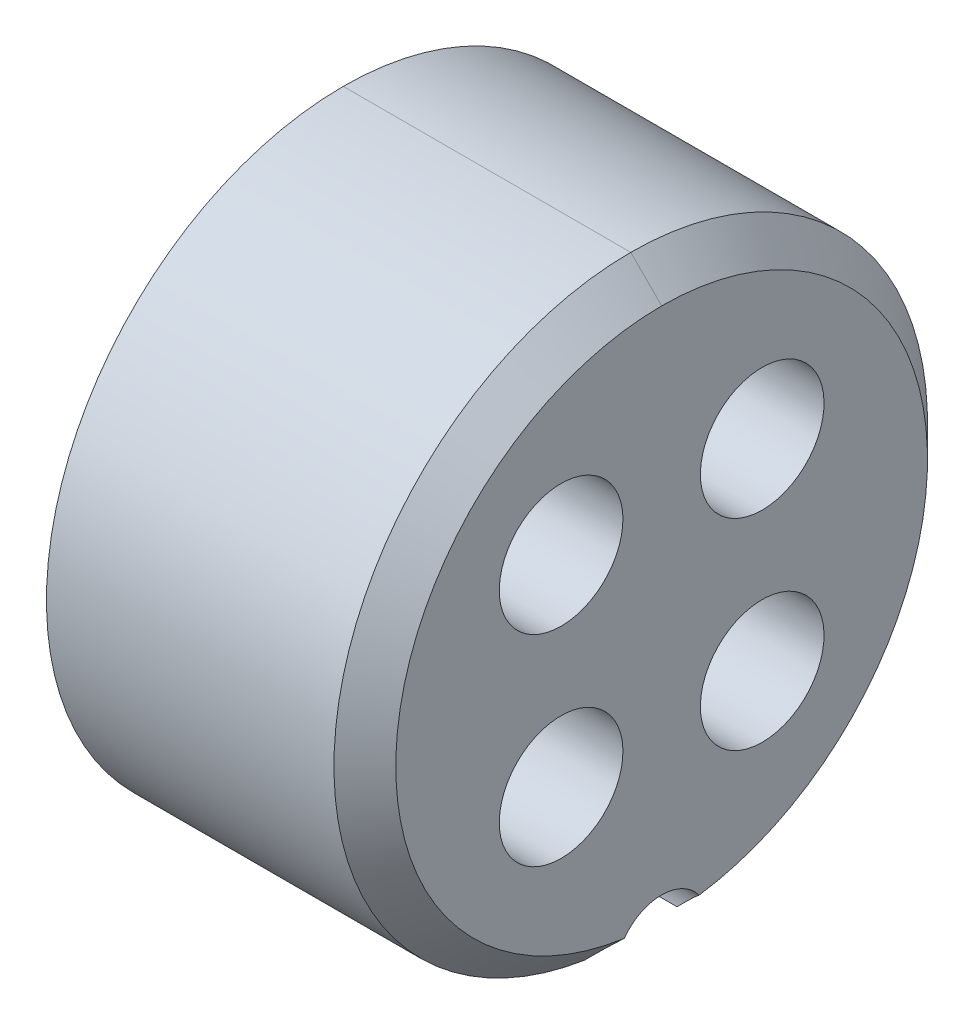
ISO-10303-21;
HEADER;
FILE_DESCRIPTION(('STEP AP214'),'2;1');
FILE_NAME('part.step','',(''),(''),'','','');
FILE_SCHEMA(('AUTOMOTIVE_DESIGN { 1 0 10303 214 1 1 1 1 }'));
ENDSEC;
DATA;
#1=APPLICATION_CONTEXT('core data for automotive mechanical design processes');
#2=APPLICATION_PROTOCOL_DEFINITION('international standard','automotive_design',2000,#1);
#3=PRODUCT_CONTEXT('',#1,'mechanical');
#4=PRODUCT('Part','Part','',(#3));
#5=PRODUCT_RELATED_PRODUCT_CATEGORY('part','',(#4));
#6=PRODUCT_DEFINITION_FORMATION('','',#4);
#7=PRODUCT_DEFINITION_CONTEXT('part definition',#1,'design');
#8=PRODUCT_DEFINITION('design','',#6,#7);
#9=PRODUCT_DEFINITION_SHAPE('','',#8);
#10=(LENGTH_UNIT() NAMED_UNIT(*) SI_UNIT(.MILLI.,.METRE.));
#11=(NAMED_UNIT(*) PLANE_ANGLE_UNIT() SI_UNIT($,.RADIAN.));
#12=(NAMED_UNIT(*) SI_UNIT($,.STERADIAN.) SOLID_ANGLE_UNIT());
#13=UNCERTAINTY_MEASURE_WITH_UNIT(LENGTH_MEASURE(1.E-05),#10,'distance_accuracy_value','');
#14=(GEOMETRIC_REPRESENTATION_CONTEXT(3) GLOBAL_UNCERTAINTY_ASSIGNED_CONTEXT((#13)) GLOBAL_UNIT_ASSIGNED_CONTEXT((#10,
#11,#12)) REPRESENTATION_CONTEXT('',''));
#15=CARTESIAN_POINT('',(0.,0.,0.));
#16=DIRECTION('',(0.,0.,1.));
#17=DIRECTION('',(1.,0.,0.));
#18=AXIS2_PLACEMENT_3D('',#15,#16,#17);
#19=CARTESIAN_POINT('',(3.6,1.626345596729,-1.626345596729));
#20=DIRECTION('',(-1.,0.,0.));
#21=DIRECTION('',(0.,0.,1.));
#22=AXIS2_PLACEMENT_3D('',#19,#20,#21);
#23=CYLINDRICAL_SURFACE('',#22,1.);
#24=CARTESIAN_POINT('',(8.75,1.626345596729,-1.626345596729));
#25=DIRECTION('',(-1.,0.,0.));
#26=DIRECTION('',(0.,0.,1.));
#27=AXIS2_PLACEMENT_3D('',#24,#25,#26);
#28=CIRCLE('',#27,1.);
#29=CARTESIAN_POINT('',(8.75,0.626345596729,-1.626345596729));
#30=VERTEX_POINT('',#29);
#31=EDGE_CURVE('E208',#30,#30,#28,.T.);
#32=ORIENTED_EDGE('',*,*,#31,.F.);
#33=DIRECTION('',(-1.,0.,0.));
#34=VECTOR('',#33,1.);
#35=CARTESIAN_POINT('',(3.6,0.626345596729,-1.626345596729));
#36=LINE('',#35,#34);
#37=CARTESIAN_POINT('',(3.6,0.626345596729,-1.626345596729));
#38=VERTEX_POINT('',#37);
#39=EDGE_CURVE('E20',#38,#30,#36,.F.);
#40=ORIENTED_EDGE('',*,*,#39,.F.);
#41=CARTESIAN_POINT('',(3.6,1.626345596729,-1.626345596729));
#42=DIRECTION('',(-1.,0.,0.));
#43=DIRECTION('',(0.,0.,1.));
#44=AXIS2_PLACEMENT_3D('',#41,#42,#43);
#45=CIRCLE('',#44,1.);
#46=EDGE_CURVE('E47',#38,#38,#45,.T.);
#47=ORIENTED_EDGE('',*,*,#46,.T.);
#48=ORIENTED_EDGE('',*,*,#39,.T.);
#49=EDGE_LOOP('',(#32,#40,#47,#48));
#50=FACE_BOUND('',#49,.T.);
#51=ADVANCED_FACE('F17',(#50),#23,.F.);
#52=CARTESIAN_POINT('',(3.6,-1.626345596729,-1.626345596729));
#53=DIRECTION('',(-1.,0.,0.));
#54=DIRECTION('',(0.,0.,1.));
#55=AXIS2_PLACEMENT_3D('',#52,#53,#54);
#56=CYLINDRICAL_SURFACE('',#55,1.);
#57=CARTESIAN_POINT('',(8.75,-1.626345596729,-1.626345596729));
#58=DIRECTION('',(-1.,0.,0.));
#59=DIRECTION('',(0.,0.,1.));
#60=AXIS2_PLACEMENT_3D('',#57,#58,#59);
#61=CIRCLE('',#60,1.);
#62=CARTESIAN_POINT('',(8.75,-2.626345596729,-1.626345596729));
#63=VERTEX_POINT('',#62);
#64=EDGE_CURVE('E34',#63,#63,#61,.T.);
#65=ORIENTED_EDGE('',*,*,#64,.F.);
#66=DIRECTION('',(-1.,0.,0.));
#67=VECTOR('',#66,1.);
#68=CARTESIAN_POINT('',(3.6,-2.626345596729,-1.626345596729));
#69=LINE('',#68,#67);
#70=CARTESIAN_POINT('',(3.6,-2.626345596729,-1.626345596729));
#71=VERTEX_POINT('',#70);
#72=EDGE_CURVE('E216',#71,#63,#69,.F.);
#73=ORIENTED_EDGE('',*,*,#72,.F.);
#74=CARTESIAN_POINT('',(3.6,-1.626345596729,-1.626345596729));
#75=DIRECTION('',(-1.,0.,0.));
#76=DIRECTION('',(0.,0.,1.));
#77=AXIS2_PLACEMENT_3D('',#74,#75,#76);
#78=CIRCLE('',#77,1.);
#79=EDGE_CURVE('E52',#71,#71,#78,.T.);
#80=ORIENTED_EDGE('',*,*,#79,.T.);
#81=ORIENTED_EDGE('',*,*,#72,.T.);
#82=EDGE_LOOP('',(#65,#73,#80,#81));
#83=FACE_BOUND('',#82,.T.);
#84=ADVANCED_FACE('F168',(#83),#56,.F.);
#85=CARTESIAN_POINT('',(3.6,1.626345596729,1.626345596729));
#86=DIRECTION('',(-1.,0.,0.));
#87=DIRECTION('',(0.,0.,1.));
#88=AXIS2_PLACEMENT_3D('',#85,#86,#87);
#89=CYLINDRICAL_SURFACE('',#88,1.);
#90=CARTESIAN_POINT('',(8.75,1.626345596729,1.626345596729));
#91=DIRECTION('',(-1.,0.,0.));
#92=DIRECTION('',(0.,0.,1.));
#93=AXIS2_PLACEMENT_3D('',#90,#91,#92);
#94=CIRCLE('',#93,1.);
#95=CARTESIAN_POINT('',(8.75,0.626345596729,1.626345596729));
#96=VERTEX_POINT('',#95);
#97=EDGE_CURVE('E202',#96,#96,#94,.T.);
#98=ORIENTED_EDGE('',*,*,#97,.F.);
#99=DIRECTION('',(-1.,0.,0.));
#100=VECTOR('',#99,1.);
#101=CARTESIAN_POINT('',(3.6,0.626345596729,1.626345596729));
#102=LINE('',#101,#100);
#103=CARTESIAN_POINT('',(3.6,0.626345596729,1.626345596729));
#104=VERTEX_POINT('',#103);
#105=EDGE_CURVE('E215',#104,#96,#102,.F.);
#106=ORIENTED_EDGE('',*,*,#105,.F.);
#107=CARTESIAN_POINT('',(3.6,1.626345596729,1.626345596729));
#108=DIRECTION('',(-1.,0.,0.));
#109=DIRECTION('',(0.,0.,1.));
#110=AXIS2_PLACEMENT_3D('',#107,#108,#109);
#111=CIRCLE('',#110,1.);
#112=EDGE_CURVE('E60',#104,#104,#111,.T.);
#113=ORIENTED_EDGE('',*,*,#112,.T.);
#114=ORIENTED_EDGE('',*,*,#105,.T.);
#115=EDGE_LOOP('',(#98,#106,#113,#114));
#116=FACE_BOUND('',#115,.T.);
#117=ADVANCED_FACE('F165',(#116),#89,.F.);
#118=CARTESIAN_POINT('',(3.6,-1.626345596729,1.626345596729));
#119=DIRECTION('',(-1.,0.,0.));
#120=DIRECTION('',(0.,0.,1.));
#121=AXIS2_PLACEMENT_3D('',#118,#119,#120);
#122=CYLINDRICAL_SURFACE('',#121,1.);
#123=CARTESIAN_POINT('',(8.75,-1.626345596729,1.626345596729));
#124=DIRECTION('',(-1.,0.,0.));
#125=DIRECTION('',(0.,0.,1.));
#126=AXIS2_PLACEMENT_3D('',#123,#124,#125);
#127=CIRCLE('',#126,1.);
#128=CARTESIAN_POINT('',(8.75,-2.626345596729,1.626345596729));
#129=VERTEX_POINT('',#128);
#130=EDGE_CURVE('E205',#129,#129,#127,.T.);
#131=ORIENTED_EDGE('',*,*,#130,.F.);
#132=DIRECTION('',(-1.,0.,0.));
#133=VECTOR('',#132,1.);
#134=CARTESIAN_POINT('',(3.6,-2.626345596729,1.626345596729));
#135=LINE('',#134,#133);
#136=CARTESIAN_POINT('',(3.6,-2.626345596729,1.626345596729));
#137=VERTEX_POINT('',#136);
#138=EDGE_CURVE('E212',#137,#129,#135,.F.);
#139=ORIENTED_EDGE('',*,*,#138,.F.);
#140=CARTESIAN_POINT('',(3.6,-1.626345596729,1.626345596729));
#141=DIRECTION('',(-1.,0.,0.));
#142=DIRECTION('',(0.,0.,1.));
#143=AXIS2_PLACEMENT_3D('',#140,#141,#142);
#144=CIRCLE('',#143,1.);
#145=EDGE_CURVE('E189',#137,#137,#144,.T.);
#146=ORIENTED_EDGE('',*,*,#145,.T.);
#147=ORIENTED_EDGE('',*,*,#138,.T.);
#148=EDGE_LOOP('',(#131,#139,#146,#147));
#149=FACE_BOUND('',#148,.T.);
#150=ADVANCED_FACE('F161',(#149),#122,.F.);
#151=CARTESIAN_POINT('',(8.75,0.,0.));
#152=DIRECTION('',(1.,0.,0.));
#153=DIRECTION('',(0.,0.,-1.));
#154=AXIS2_PLACEMENT_3D('',#151,#152,#153);
#155=PLANE('',#154);
#156=ORIENTED_EDGE('',*,*,#97,.T.);
#157=EDGE_LOOP('',(#156));
#158=FACE_BOUND('',#157,.T.);
#159=ORIENTED_EDGE('',*,*,#130,.T.);
#160=EDGE_LOOP('',(#159));
#161=FACE_BOUND('',#160,.T.);
#162=ORIENTED_EDGE('',*,*,#31,.T.);
#163=EDGE_LOOP('',(#162));
#164=FACE_BOUND('',#163,.T.);
#165=ORIENTED_EDGE('',*,*,#64,.T.);
#166=EDGE_LOOP('',(#165));
#167=FACE_BOUND('',#166,.T.);
#168=CARTESIAN_POINT('',(8.74999999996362,0.,0.));
#169=DIRECTION('',(-1.,0.,0.));
#170=DIRECTION('',(0.,0.,1.));
#171=AXIS2_PLACEMENT_3D('',#168,#169,#170);
#172=CIRCLE('',#171,4.30000000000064);
#173=CARTESIAN_POINT('',(8.7499999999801,-4.25718085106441,0.605319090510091));
#174=VERTEX_POINT('',#173);
#175=CARTESIAN_POINT('',(8.74999999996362,4.30000000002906,0.));
#176=VERTEX_POINT('',#175);
#177=EDGE_CURVE('E108',#174,#176,#172,.T.);
#178=ORIENTED_EDGE('',*,*,#177,.F.);
#179=CARTESIAN_POINT('',(8.75,-4.7,0.));
#180=DIRECTION('',(-1.,0.,0.));
#181=DIRECTION('',(0.,0.,1.));
#182=AXIS2_PLACEMENT_3D('',#179,#180,#181);
#183=CIRCLE('',#182,0.75);
#184=CARTESIAN_POINT('',(8.74999999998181,-4.25718085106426,-0.605319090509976));
#185=VERTEX_POINT('',#184);
#186=EDGE_CURVE('E146',#174,#185,#183,.T.);
#187=ORIENTED_EDGE('',*,*,#186,.T.);
#188=CARTESIAN_POINT('',(8.74999999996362,0.,0.));
#189=DIRECTION('',(-1.,0.,0.));
#190=DIRECTION('',(0.,0.,1.));
#191=AXIS2_PLACEMENT_3D('',#188,#189,#190);
#192=CIRCLE('',#191,4.30000000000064);
#193=EDGE_CURVE('E116',#176,#185,#192,.T.);
#194=ORIENTED_EDGE('',*,*,#193,.F.);
#195=EDGE_LOOP('',(#178,#187,#194));
#196=FACE_BOUND('',#195,.T.);
#197=ADVANCED_FACE('F156',(#158,#161,#164,#167,#196),#155,.T.);
#198=CARTESIAN_POINT('',(8.25000000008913,0.,0.));
#199=DIRECTION('',(-1.,0.,0.));
#200=DIRECTION('',(0.,0.,1.));
#201=AXIS2_PLACEMENT_3D('',#198,#199,#200);
#202=CONICAL_SURFACE('',#201,4.79999999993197,0.785398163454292);
#203=ORIENTED_EDGE('',*,*,#193,.T.);
#204=CARTESIAN_POINT('',(8.74999999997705,-4.25718085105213,-0.605319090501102));
#205=CARTESIAN_POINT('',(8.72391239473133,-4.28104505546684,-0.622760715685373));
#206=CARTESIAN_POINT('',(8.69735237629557,-4.30556485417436,-0.638549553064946));
#207=CARTESIAN_POINT('',(8.6435659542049,-4.35568576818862,-0.666919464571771));
#208=CARTESIAN_POINT('',(8.61633981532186,-4.38128645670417,-0.679501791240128));
#209=CARTESIAN_POINT('',(8.5620016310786,-4.43286200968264,-0.701359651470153));
#210=CARTESIAN_POINT('',(8.53489730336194,-4.45882043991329,-0.710693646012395));
#211=CARTESIAN_POINT('',(8.48049056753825,-4.51140176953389,-0.726418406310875));
#212=CARTESIAN_POINT('',(8.45318818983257,-4.5380245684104,-0.732809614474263));
#213=CARTESIAN_POINT('',(8.39661327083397,-4.59368657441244,-0.743003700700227));
#214=CARTESIAN_POINT('',(8.36733840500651,-4.62276319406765,-0.746590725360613));
#215=CARTESIAN_POINT('',(8.3086462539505,-4.68160196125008,-0.750357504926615));
#216=CARTESIAN_POINT('',(8.27923066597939,-4.71136809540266,-0.750501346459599));
#217=CARTESIAN_POINT('',(8.25000000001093,-4.74122340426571,-0.748866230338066));
#218=B_SPLINE_CURVE_WITH_KNOTS('',3,(#204,#205,#206,#207,#208,#209,#210,#211,#212,#213,#214,
#215,#216,#217),.UNSPECIFIED.,.F.,.F.,(4,2,2,2,2,2,4),(0.,0.118198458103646,0.236350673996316,
0.352250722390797,0.468133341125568,0.592239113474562,0.717638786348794),.UNSPECIFIED.);
#219=CARTESIAN_POINT('',(8.25000000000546,-4.74122340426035,-0.748866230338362));
#220=VERTEX_POINT('',#219);
#221=EDGE_CURVE('E102',#185,#220,#218,.T.);
#222=ORIENTED_EDGE('',*,*,#221,.T.);
#223=CARTESIAN_POINT('',(8.25,0.,0.));
#224=DIRECTION('',(1.,0.,0.));
#225=DIRECTION('',(0.,0.,-1.));
#226=AXIS2_PLACEMENT_3D('',#223,#224,#225);
#227=CIRCLE('',#226,4.8);
#228=CARTESIAN_POINT('',(8.25000000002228,4.79999999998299,0.));
#229=VERTEX_POINT('',#228);
#230=EDGE_CURVE('E95',#229,#220,#227,.F.);
#231=ORIENTED_EDGE('',*,*,#230,.F.);
#232=DIRECTION('',(0.707106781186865,-0.70710678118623,0.));
#233=VECTOR('',#232,1.);
#234=CARTESIAN_POINT('',(-498986.950000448,499000.,0.));
#235=LINE('',#234,#233);
#236=EDGE_CURVE('E99',#176,#229,#235,.F.);
#237=ORIENTED_EDGE('',*,*,#236,.F.);
#238=EDGE_LOOP('',(#203,#222,#231,#237));
#239=FACE_BOUND('',#238,.T.);
#240=ADVANCED_FACE('F98',(#239),#202,.T.);
#241=CARTESIAN_POINT('',(8.25000000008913,0.,0.));
#242=DIRECTION('',(-1.,0.,0.));
#243=DIRECTION('',(0.,0.,1.));
#244=AXIS2_PLACEMENT_3D('',#241,#242,#243);
#245=CONICAL_SURFACE('',#244,4.79999999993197,0.785398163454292);
#246=CARTESIAN_POINT('',(8.25000000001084,-4.7412234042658,0.748866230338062));
#247=CARTESIAN_POINT('',(8.27952794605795,-4.71106435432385,0.750517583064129));
#248=CARTESIAN_POINT('',(8.30924439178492,-4.68099665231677,0.750354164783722));
#249=CARTESIAN_POINT('',(8.36886601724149,-4.62123757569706,0.74645639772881));
#250=CARTESIAN_POINT('',(8.39877131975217,-4.59154649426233,0.742719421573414));
#251=CARTESIAN_POINT('',(8.45790291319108,-4.53340408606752,0.731847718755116));
#252=CARTESIAN_POINT('',(8.48713012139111,-4.50493982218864,0.724786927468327));
#253=CARTESIAN_POINT('',(8.54531509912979,-4.44881282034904,0.707296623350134));
#254=CARTESIAN_POINT('',(8.57427302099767,-4.42114960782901,0.696869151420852));
#255=CARTESIAN_POINT('',(8.62788489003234,-4.37042374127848,0.67420060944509));
#256=CARTESIAN_POINT('',(8.65260056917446,-4.34723729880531,0.662383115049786));
#257=CARTESIAN_POINT('',(8.7016811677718,-4.30157056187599,0.635965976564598));
#258=CARTESIAN_POINT('',(8.72604063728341,-4.27909891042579,0.621341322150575));
#259=CARTESIAN_POINT('',(8.74999999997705,-4.25718085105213,0.605319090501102));
#260=B_SPLINE_CURVE_WITH_KNOTS('',3,(#246,#247,#248,#249,#250,#251,#252,#253,#254,#255,#256,
#257,#258,#259),.UNSPECIFIED.,.F.,.F.,(4,2,2,2,2,2,4),(0.,0.126673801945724,0.253440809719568,
0.377512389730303,0.501508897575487,0.609070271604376,0.71763861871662),.UNSPECIFIED.);
#261=CARTESIAN_POINT('',(8.25000000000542,-4.74122340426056,0.74886623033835));
#262=VERTEX_POINT('',#261);
#263=EDGE_CURVE('E188',#262,#174,#260,.T.);
#264=ORIENTED_EDGE('',*,*,#263,.T.);
#265=ORIENTED_EDGE('',*,*,#177,.T.);
#266=ORIENTED_EDGE('',*,*,#236,.T.);
#267=CARTESIAN_POINT('',(8.25,0.,0.));
#268=DIRECTION('',(1.,0.,0.));
#269=DIRECTION('',(0.,0.,-1.));
#270=AXIS2_PLACEMENT_3D('',#267,#268,#269);
#271=CIRCLE('',#270,4.8);
#272=EDGE_CURVE('E114',#262,#229,#271,.F.);
#273=ORIENTED_EDGE('',*,*,#272,.F.);
#274=EDGE_LOOP('',(#264,#265,#266,#273));
#275=FACE_BOUND('',#274,.T.);
#276=ADVANCED_FACE('F112',(#275),#245,.T.);
#277=CARTESIAN_POINT('',(3.6,0.,0.));
#278=DIRECTION('',(1.,0.,0.));
#279=DIRECTION('',(0.,0.,-1.));
#280=AXIS2_PLACEMENT_3D('',#277,#278,#279);
#281=CYLINDRICAL_SURFACE('',#280,4.8);
#282=DIRECTION('',(-1.,0.,0.));
#283=VECTOR('',#282,1.);
#284=CARTESIAN_POINT('',(3.6,-4.74122340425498,-0.748866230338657));
#285=LINE('',#284,#283);
#286=CARTESIAN_POINT('',(3.6,-4.74122340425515,-0.748866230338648));
#287=VERTEX_POINT('',#286);
#288=EDGE_CURVE('E127',#220,#287,#285,.T.);
#289=ORIENTED_EDGE('',*,*,#288,.T.);
#290=CARTESIAN_POINT('',(3.6,0.,0.));
#291=DIRECTION('',(1.,0.,0.));
#292=DIRECTION('',(0.,0.,-1.));
#293=AXIS2_PLACEMENT_3D('',#290,#291,#292);
#294=CIRCLE('',#293,4.8);
#295=CARTESIAN_POINT('',(3.6,4.8,0.));
#296=VERTEX_POINT('',#295);
#297=EDGE_CURVE('E107',#287,#296,#294,.T.);
#298=ORIENTED_EDGE('',*,*,#297,.T.);
#299=DIRECTION('',(1.,0.,0.));
#300=VECTOR('',#299,1.);
#301=CARTESIAN_POINT('',(3.6,4.8,0.));
#302=LINE('',#301,#300);
#303=EDGE_CURVE('E119',#229,#296,#302,.F.);
#304=ORIENTED_EDGE('',*,*,#303,.F.);
#305=ORIENTED_EDGE('',*,*,#230,.T.);
#306=EDGE_LOOP('',(#289,#298,#304,#305));
#307=FACE_BOUND('',#306,.T.);
#308=ADVANCED_FACE('F120',(#307),#281,.T.);
#309=CARTESIAN_POINT('',(3.6,0.,0.));
#310=DIRECTION('',(1.,0.,0.));
#311=DIRECTION('',(0.,0.,-1.));
#312=AXIS2_PLACEMENT_3D('',#309,#310,#311);
#313=PLANE('',#312);
#314=ORIENTED_EDGE('',*,*,#145,.F.);
#315=EDGE_LOOP('',(#314));
#316=FACE_BOUND('',#315,.T.);
#317=ORIENTED_EDGE('',*,*,#112,.F.);
#318=EDGE_LOOP('',(#317));
#319=FACE_BOUND('',#318,.T.);
#320=ORIENTED_EDGE('',*,*,#79,.F.);
#321=EDGE_LOOP('',(#320));
#322=FACE_BOUND('',#321,.T.);
#323=ORIENTED_EDGE('',*,*,#46,.F.);
#324=EDGE_LOOP('',(#323));
#325=FACE_BOUND('',#324,.T.);
#326=ORIENTED_EDGE('',*,*,#297,.F.);
#327=CARTESIAN_POINT('',(3.6,-4.7,0.));
#328=DIRECTION('',(-1.,0.,0.));
#329=DIRECTION('',(0.,0.,1.));
#330=AXIS2_PLACEMENT_3D('',#327,#328,#329);
#331=CIRCLE('',#330,0.75);
#332=CARTESIAN_POINT('',(3.6,-4.74122340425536,0.748866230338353));
#333=VERTEX_POINT('',#332);
#334=EDGE_CURVE('E186',#287,#333,#331,.F.);
#335=ORIENTED_EDGE('',*,*,#334,.T.);
#336=CARTESIAN_POINT('',(3.6,0.,0.));
#337=DIRECTION('',(1.,0.,0.));
#338=DIRECTION('',(0.,0.,-1.));
#339=AXIS2_PLACEMENT_3D('',#336,#337,#338);
#340=CIRCLE('',#339,4.8);
#341=EDGE_CURVE('E26',#296,#333,#340,.T.);
#342=ORIENTED_EDGE('',*,*,#341,.F.);
#343=EDGE_LOOP('',(#326,#335,#342));
#344=FACE_BOUND('',#343,.T.);
#345=ADVANCED_FACE('F178',(#316,#319,#322,#325,#344),#313,.F.);
#346=CARTESIAN_POINT('',(3.6,-4.7,0.));
#347=DIRECTION('',(-1.,0.,0.));
#348=DIRECTION('',(0.,0.,1.));
#349=AXIS2_PLACEMENT_3D('',#346,#347,#348);
#350=CYLINDRICAL_SURFACE('',#349,0.75);
#351=ORIENTED_EDGE('',*,*,#221,.F.);
#352=ORIENTED_EDGE('',*,*,#186,.F.);
#353=ORIENTED_EDGE('',*,*,#263,.F.);
#354=DIRECTION('',(1.,0.,0.));
#355=VECTOR('',#354,1.);
#356=CARTESIAN_POINT('',(3.6,-4.74122340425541,0.748866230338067));
#357=LINE('',#356,#355);
#358=EDGE_CURVE('E11',#333,#262,#357,.T.);
#359=ORIENTED_EDGE('',*,*,#358,.F.);
#360=ORIENTED_EDGE('',*,*,#334,.F.);
#361=ORIENTED_EDGE('',*,*,#288,.F.);
#362=EDGE_LOOP('',(#351,#352,#353,#359,#360,#361));
#363=FACE_BOUND('',#362,.T.);
#364=ADVANCED_FACE('F148',(#363),#350,.F.);
#365=CARTESIAN_POINT('',(3.6,0.,0.));
#366=DIRECTION('',(1.,0.,0.));
#367=DIRECTION('',(0.,0.,-1.));
#368=AXIS2_PLACEMENT_3D('',#365,#366,#367);
#369=CYLINDRICAL_SURFACE('',#368,4.8);
#370=ORIENTED_EDGE('',*,*,#341,.T.);
#371=ORIENTED_EDGE('',*,*,#358,.T.);
#372=ORIENTED_EDGE('',*,*,#272,.T.);
#373=ORIENTED_EDGE('',*,*,#303,.T.);
#374=EDGE_LOOP('',(#370,#371,#372,#373));
#375=FACE_BOUND('',#374,.T.);
#376=ADVANCED_FACE('F125',(#375),#369,.T.);
#377=CLOSED_SHELL('',(#51,#84,#117,#150,#197,#240,#276,#308,#345,#364,#376));
#378=MANIFOLD_SOLID_BREP('B1',#377);
#379=ADVANCED_BREP_SHAPE_REPRESENTATION('',(#18,#378),#14);
#380=SHAPE_DEFINITION_REPRESENTATION(#9,#379);
ENDSEC;
END-ISO-10303-21;
